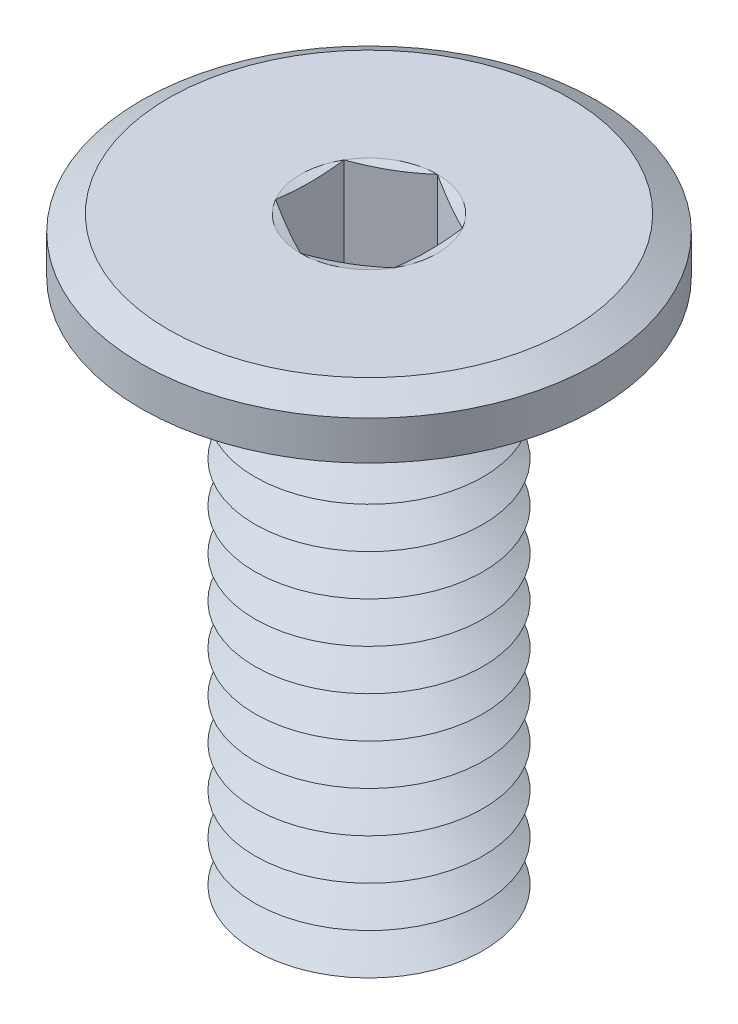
ISO-10303-21;
HEADER;
FILE_DESCRIPTION(('STEP AP214'),'2;1');
FILE_NAME('part.step','',(''),(''),'','','');
FILE_SCHEMA(('AUTOMOTIVE_DESIGN { 1 0 10303 214 1 1 1 1 }'));
ENDSEC;
DATA;
#1=APPLICATION_CONTEXT('core data for automotive mechanical design processes');
#2=APPLICATION_PROTOCOL_DEFINITION('international standard','automotive_design',2000,#1);
#3=PRODUCT_CONTEXT('',#1,'mechanical');
#4=PRODUCT('Part','Part','',(#3));
#5=PRODUCT_RELATED_PRODUCT_CATEGORY('part','',(#4));
#6=PRODUCT_DEFINITION_FORMATION('','',#4);
#7=PRODUCT_DEFINITION_CONTEXT('part definition',#1,'design');
#8=PRODUCT_DEFINITION('design','',#6,#7);
#9=PRODUCT_DEFINITION_SHAPE('','',#8);
#10=(LENGTH_UNIT() NAMED_UNIT(*) SI_UNIT(.MILLI.,.METRE.));
#11=(NAMED_UNIT(*) PLANE_ANGLE_UNIT() SI_UNIT($,.RADIAN.));
#12=(NAMED_UNIT(*) SI_UNIT($,.STERADIAN.) SOLID_ANGLE_UNIT());
#13=UNCERTAINTY_MEASURE_WITH_UNIT(LENGTH_MEASURE(1.E-05),#10,'distance_accuracy_value','');
#14=(GEOMETRIC_REPRESENTATION_CONTEXT(3) GLOBAL_UNCERTAINTY_ASSIGNED_CONTEXT((#13)) GLOBAL_UNIT_ASSIGNED_CONTEXT((#10,
#11,#12)) REPRESENTATION_CONTEXT('',''));
#15=CARTESIAN_POINT('',(0.,0.,0.));
#16=DIRECTION('',(0.,0.,1.));
#17=DIRECTION('',(1.,0.,0.));
#18=AXIS2_PLACEMENT_3D('',#15,#16,#17);
#19=CARTESIAN_POINT('',(0.,-5.925,0.));
#20=DIRECTION('',(0.,-1.,0.));
#21=DIRECTION('',(0.,0.,-1.));
#22=AXIS2_PLACEMENT_3D('',#19,#20,#21);
#23=CONICAL_SURFACE('',#22,1.25,1.0471975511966);
#24=CARTESIAN_POINT('',(0.,-5.7,0.));
#25=DIRECTION('',(0.,1.,0.));
#26=DIRECTION('',(0.,0.,1.));
#27=AXIS2_PLACEMENT_3D('',#24,#25,#26);
#28=CIRCLE('',#27,0.860288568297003);
#29=CARTESIAN_POINT('',(0.,-5.7,0.860288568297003));
#30=VERTEX_POINT('',#29);
#31=EDGE_CURVE('E450',#30,#30,#28,.T.);
#32=ORIENTED_EDGE('',*,*,#31,.F.);
#33=EDGE_LOOP('',(#32));
#34=FACE_BOUND('',#33,.T.);
#35=CARTESIAN_POINT('',(0.,-5.925,0.));
#36=DIRECTION('',(0.,1.,0.));
#37=DIRECTION('',(0.,0.,1.));
#38=AXIS2_PLACEMENT_3D('',#35,#36,#37);
#39=CIRCLE('',#38,1.25);
#40=CARTESIAN_POINT('',(0.,-5.925,1.25));
#41=VERTEX_POINT('',#40);
#42=EDGE_CURVE('E454',#41,#41,#39,.T.);
#43=ORIENTED_EDGE('',*,*,#42,.T.);
#44=EDGE_LOOP('',(#43));
#45=FACE_BOUND('',#44,.T.);
#46=ADVANCED_FACE('F39',(#34,#45),#23,.T.);
#47=CARTESIAN_POINT('',(0.,-5.7,0.));
#48=DIRECTION('',(0.,1.,0.));
#49=DIRECTION('',(0.,0.,1.));
#50=AXIS2_PLACEMENT_3D('',#47,#48,#49);
#51=CONICAL_SURFACE('',#50,0.860288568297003,1.0471975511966);
#52=CARTESIAN_POINT('',(0.,-5.475,0.));
#53=DIRECTION('',(0.,1.,0.));
#54=DIRECTION('',(0.,0.,1.));
#55=AXIS2_PLACEMENT_3D('',#52,#53,#54);
#56=CIRCLE('',#55,1.25);
#57=CARTESIAN_POINT('',(0.,-5.475,1.25));
#58=VERTEX_POINT('',#57);
#59=EDGE_CURVE('E446',#58,#58,#56,.T.);
#60=ORIENTED_EDGE('',*,*,#59,.F.);
#61=EDGE_LOOP('',(#60));
#62=FACE_BOUND('',#61,.T.);
#63=ORIENTED_EDGE('',*,*,#31,.T.);
#64=EDGE_LOOP('',(#63));
#65=FACE_BOUND('',#64,.T.);
#66=ADVANCED_FACE('F233',(#62,#65),#51,.T.);
#67=CARTESIAN_POINT('',(0.,-6.6,0.));
#68=DIRECTION('',(0.,-1.,0.));
#69=DIRECTION('',(0.,0.,-1.));
#70=AXIS2_PLACEMENT_3D('',#67,#68,#69);
#71=PLANE('',#70);
#72=CARTESIAN_POINT('',(0.,-6.6,0.));
#73=DIRECTION('',(0.,1.,0.));
#74=DIRECTION('',(0.,0.,1.));
#75=AXIS2_PLACEMENT_3D('',#72,#73,#74);
#76=CIRCLE('',#75,0.860288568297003);
#77=CARTESIAN_POINT('',(0.,-6.6,0.860288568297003));
#78=VERTEX_POINT('',#77);
#79=EDGE_CURVE('E300',#78,#78,#76,.T.);
#80=ORIENTED_EDGE('',*,*,#79,.F.);
#81=EDGE_LOOP('',(#80));
#82=FACE_BOUND('',#81,.T.);
#83=ADVANCED_FACE('F239',(#82),#71,.T.);
#84=CARTESIAN_POINT('',(0.,-6.6,0.));
#85=DIRECTION('',(0.,1.,0.));
#86=DIRECTION('',(0.,0.,1.));
#87=AXIS2_PLACEMENT_3D('',#84,#85,#86);
#88=CONICAL_SURFACE('',#87,0.860288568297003,1.0471975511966);
#89=CARTESIAN_POINT('',(0.,-6.375,0.));
#90=DIRECTION('',(0.,1.,0.));
#91=DIRECTION('',(0.,0.,1.));
#92=AXIS2_PLACEMENT_3D('',#89,#90,#91);
#93=CIRCLE('',#92,1.25);
#94=CARTESIAN_POINT('',(0.,-6.375,1.25));
#95=VERTEX_POINT('',#94);
#96=EDGE_CURVE('E462',#95,#95,#93,.T.);
#97=ORIENTED_EDGE('',*,*,#96,.F.);
#98=EDGE_LOOP('',(#97));
#99=FACE_BOUND('',#98,.T.);
#100=ORIENTED_EDGE('',*,*,#79,.T.);
#101=EDGE_LOOP('',(#100));
#102=FACE_BOUND('',#101,.T.);
#103=ADVANCED_FACE('F254',(#99,#102),#88,.T.);
#104=CARTESIAN_POINT('',(0.,-6.375,0.));
#105=DIRECTION('',(0.,-1.,0.));
#106=DIRECTION('',(0.,0.,-1.));
#107=AXIS2_PLACEMENT_3D('',#104,#105,#106);
#108=CONICAL_SURFACE('',#107,1.25,1.0471975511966);
#109=CARTESIAN_POINT('',(0.,-6.15,0.));
#110=DIRECTION('',(0.,1.,0.));
#111=DIRECTION('',(0.,0.,1.));
#112=AXIS2_PLACEMENT_3D('',#109,#110,#111);
#113=CIRCLE('',#112,0.860288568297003);
#114=CARTESIAN_POINT('',(0.,-6.15,0.860288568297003));
#115=VERTEX_POINT('',#114);
#116=EDGE_CURVE('E458',#115,#115,#113,.T.);
#117=ORIENTED_EDGE('',*,*,#116,.F.);
#118=EDGE_LOOP('',(#117));
#119=FACE_BOUND('',#118,.T.);
#120=ORIENTED_EDGE('',*,*,#96,.T.);
#121=EDGE_LOOP('',(#120));
#122=FACE_BOUND('',#121,.T.);
#123=ADVANCED_FACE('F250',(#119,#122),#108,.T.);
#124=CARTESIAN_POINT('',(0.,-6.15,0.));
#125=DIRECTION('',(0.,1.,0.));
#126=DIRECTION('',(0.,0.,1.));
#127=AXIS2_PLACEMENT_3D('',#124,#125,#126);
#128=CONICAL_SURFACE('',#127,0.860288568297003,1.0471975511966);
#129=ORIENTED_EDGE('',*,*,#42,.F.);
#130=EDGE_LOOP('',(#129));
#131=FACE_BOUND('',#130,.T.);
#132=ORIENTED_EDGE('',*,*,#116,.T.);
#133=EDGE_LOOP('',(#132));
#134=FACE_BOUND('',#133,.T.);
#135=ADVANCED_FACE('F246',(#131,#134),#128,.T.);
#136=CARTESIAN_POINT('',(0.,-5.475,0.));
#137=DIRECTION('',(0.,-1.,0.));
#138=DIRECTION('',(0.,0.,-1.));
#139=AXIS2_PLACEMENT_3D('',#136,#137,#138);
#140=CONICAL_SURFACE('',#139,1.25,1.0471975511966);
#141=CARTESIAN_POINT('',(0.,-5.25,0.));
#142=DIRECTION('',(0.,1.,0.));
#143=DIRECTION('',(0.,0.,1.));
#144=AXIS2_PLACEMENT_3D('',#141,#142,#143);
#145=CIRCLE('',#144,0.860288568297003);
#146=CARTESIAN_POINT('',(0.,-5.25,0.860288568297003));
#147=VERTEX_POINT('',#146);
#148=EDGE_CURVE('E443',#147,#147,#145,.T.);
#149=ORIENTED_EDGE('',*,*,#148,.F.);
#150=EDGE_LOOP('',(#149));
#151=FACE_BOUND('',#150,.T.);
#152=ORIENTED_EDGE('',*,*,#59,.T.);
#153=EDGE_LOOP('',(#152));
#154=FACE_BOUND('',#153,.T.);
#155=ADVANCED_FACE('F249',(#151,#154),#140,.T.);
#156=CARTESIAN_POINT('',(0.,-5.25,0.));
#157=DIRECTION('',(0.,1.,0.));
#158=DIRECTION('',(0.,0.,1.));
#159=AXIS2_PLACEMENT_3D('',#156,#157,#158);
#160=CONICAL_SURFACE('',#159,0.860288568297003,1.0471975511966);
#161=CARTESIAN_POINT('',(0.,-5.025,0.));
#162=DIRECTION('',(0.,1.,0.));
#163=DIRECTION('',(0.,0.,1.));
#164=AXIS2_PLACEMENT_3D('',#161,#162,#163);
#165=CIRCLE('',#164,1.25);
#166=CARTESIAN_POINT('',(0.,-5.025,1.25));
#167=VERTEX_POINT('',#166);
#168=EDGE_CURVE('E439',#167,#167,#165,.T.);
#169=ORIENTED_EDGE('',*,*,#168,.F.);
#170=EDGE_LOOP('',(#169));
#171=FACE_BOUND('',#170,.T.);
#172=ORIENTED_EDGE('',*,*,#148,.T.);
#173=EDGE_LOOP('',(#172));
#174=FACE_BOUND('',#173,.T.);
#175=ADVANCED_FACE('F599',(#171,#174),#160,.T.);
#176=CARTESIAN_POINT('',(0.,-5.025,0.));
#177=DIRECTION('',(0.,-1.,0.));
#178=DIRECTION('',(0.,0.,-1.));
#179=AXIS2_PLACEMENT_3D('',#176,#177,#178);
#180=CONICAL_SURFACE('',#179,1.25,1.0471975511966);
#181=CARTESIAN_POINT('',(0.,-4.8,0.));
#182=DIRECTION('',(0.,1.,0.));
#183=DIRECTION('',(0.,0.,1.));
#184=AXIS2_PLACEMENT_3D('',#181,#182,#183);
#185=CIRCLE('',#184,0.860288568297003);
#186=CARTESIAN_POINT('',(0.,-4.8,0.860288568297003));
#187=VERTEX_POINT('',#186);
#188=EDGE_CURVE('E436',#187,#187,#185,.T.);
#189=ORIENTED_EDGE('',*,*,#188,.F.);
#190=EDGE_LOOP('',(#189));
#191=FACE_BOUND('',#190,.T.);
#192=ORIENTED_EDGE('',*,*,#168,.T.);
#193=EDGE_LOOP('',(#192));
#194=FACE_BOUND('',#193,.T.);
#195=ADVANCED_FACE('F595',(#191,#194),#180,.T.);
#196=CARTESIAN_POINT('',(0.,-4.8,0.));
#197=DIRECTION('',(0.,1.,0.));
#198=DIRECTION('',(0.,0.,1.));
#199=AXIS2_PLACEMENT_3D('',#196,#197,#198);
#200=CONICAL_SURFACE('',#199,0.860288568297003,1.0471975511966);
#201=CARTESIAN_POINT('',(0.,-4.575,0.));
#202=DIRECTION('',(0.,1.,0.));
#203=DIRECTION('',(0.,0.,1.));
#204=AXIS2_PLACEMENT_3D('',#201,#202,#203);
#205=CIRCLE('',#204,1.25);
#206=CARTESIAN_POINT('',(0.,-4.575,1.25));
#207=VERTEX_POINT('',#206);
#208=EDGE_CURVE('E433',#207,#207,#205,.T.);
#209=ORIENTED_EDGE('',*,*,#208,.F.);
#210=EDGE_LOOP('',(#209));
#211=FACE_BOUND('',#210,.T.);
#212=ORIENTED_EDGE('',*,*,#188,.T.);
#213=EDGE_LOOP('',(#212));
#214=FACE_BOUND('',#213,.T.);
#215=ADVANCED_FACE('F591',(#211,#214),#200,.T.);
#216=CARTESIAN_POINT('',(0.,-4.575,0.));
#217=DIRECTION('',(0.,-1.,0.));
#218=DIRECTION('',(0.,0.,-1.));
#219=AXIS2_PLACEMENT_3D('',#216,#217,#218);
#220=CONICAL_SURFACE('',#219,1.25,1.0471975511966);
#221=CARTESIAN_POINT('',(0.,-4.35,0.));
#222=DIRECTION('',(0.,1.,0.));
#223=DIRECTION('',(0.,0.,1.));
#224=AXIS2_PLACEMENT_3D('',#221,#222,#223);
#225=CIRCLE('',#224,0.860288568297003);
#226=CARTESIAN_POINT('',(0.,-4.35,0.860288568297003));
#227=VERTEX_POINT('',#226);
#228=EDGE_CURVE('E429',#227,#227,#225,.T.);
#229=ORIENTED_EDGE('',*,*,#228,.F.);
#230=EDGE_LOOP('',(#229));
#231=FACE_BOUND('',#230,.T.);
#232=ORIENTED_EDGE('',*,*,#208,.T.);
#233=EDGE_LOOP('',(#232));
#234=FACE_BOUND('',#233,.T.);
#235=ADVANCED_FACE('F587',(#231,#234),#220,.T.);
#236=CARTESIAN_POINT('',(0.,-4.35,0.));
#237=DIRECTION('',(0.,1.,0.));
#238=DIRECTION('',(0.,0.,1.));
#239=AXIS2_PLACEMENT_3D('',#236,#237,#238);
#240=CONICAL_SURFACE('',#239,0.860288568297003,1.0471975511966);
#241=CARTESIAN_POINT('',(0.,-4.125,0.));
#242=DIRECTION('',(0.,1.,0.));
#243=DIRECTION('',(0.,0.,1.));
#244=AXIS2_PLACEMENT_3D('',#241,#242,#243);
#245=CIRCLE('',#244,1.25);
#246=CARTESIAN_POINT('',(0.,-4.125,1.25));
#247=VERTEX_POINT('',#246);
#248=EDGE_CURVE('E425',#247,#247,#245,.T.);
#249=ORIENTED_EDGE('',*,*,#248,.F.);
#250=EDGE_LOOP('',(#249));
#251=FACE_BOUND('',#250,.T.);
#252=ORIENTED_EDGE('',*,*,#228,.T.);
#253=EDGE_LOOP('',(#252));
#254=FACE_BOUND('',#253,.T.);
#255=ADVANCED_FACE('F583',(#251,#254),#240,.T.);
#256=CARTESIAN_POINT('',(0.,-4.125,0.));
#257=DIRECTION('',(0.,-1.,0.));
#258=DIRECTION('',(0.,0.,-1.));
#259=AXIS2_PLACEMENT_3D('',#256,#257,#258);
#260=CONICAL_SURFACE('',#259,1.25,1.0471975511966);
#261=CARTESIAN_POINT('',(0.,-3.9,0.));
#262=DIRECTION('',(0.,1.,0.));
#263=DIRECTION('',(0.,0.,1.));
#264=AXIS2_PLACEMENT_3D('',#261,#262,#263);
#265=CIRCLE('',#264,0.860288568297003);
#266=CARTESIAN_POINT('',(0.,-3.9,0.860288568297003));
#267=VERTEX_POINT('',#266);
#268=EDGE_CURVE('E421',#267,#267,#265,.T.);
#269=ORIENTED_EDGE('',*,*,#268,.F.);
#270=EDGE_LOOP('',(#269));
#271=FACE_BOUND('',#270,.T.);
#272=ORIENTED_EDGE('',*,*,#248,.T.);
#273=EDGE_LOOP('',(#272));
#274=FACE_BOUND('',#273,.T.);
#275=ADVANCED_FACE('F579',(#271,#274),#260,.T.);
#276=CARTESIAN_POINT('',(0.,-3.9,0.));
#277=DIRECTION('',(0.,1.,0.));
#278=DIRECTION('',(0.,0.,1.));
#279=AXIS2_PLACEMENT_3D('',#276,#277,#278);
#280=CONICAL_SURFACE('',#279,0.860288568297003,1.0471975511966);
#281=CARTESIAN_POINT('',(0.,-3.675,0.));
#282=DIRECTION('',(0.,1.,0.));
#283=DIRECTION('',(0.,0.,1.));
#284=AXIS2_PLACEMENT_3D('',#281,#282,#283);
#285=CIRCLE('',#284,1.25);
#286=CARTESIAN_POINT('',(0.,-3.675,1.25));
#287=VERTEX_POINT('',#286);
#288=EDGE_CURVE('E417',#287,#287,#285,.T.);
#289=ORIENTED_EDGE('',*,*,#288,.F.);
#290=EDGE_LOOP('',(#289));
#291=FACE_BOUND('',#290,.T.);
#292=ORIENTED_EDGE('',*,*,#268,.T.);
#293=EDGE_LOOP('',(#292));
#294=FACE_BOUND('',#293,.T.);
#295=ADVANCED_FACE('F575',(#291,#294),#280,.T.);
#296=CARTESIAN_POINT('',(0.,-3.675,0.));
#297=DIRECTION('',(0.,-1.,0.));
#298=DIRECTION('',(0.,0.,-1.));
#299=AXIS2_PLACEMENT_3D('',#296,#297,#298);
#300=CONICAL_SURFACE('',#299,1.25,1.0471975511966);
#301=CARTESIAN_POINT('',(0.,-3.45,0.));
#302=DIRECTION('',(0.,1.,0.));
#303=DIRECTION('',(0.,0.,1.));
#304=AXIS2_PLACEMENT_3D('',#301,#302,#303);
#305=CIRCLE('',#304,0.860288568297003);
#306=CARTESIAN_POINT('',(0.,-3.45,0.860288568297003));
#307=VERTEX_POINT('',#306);
#308=EDGE_CURVE('E413',#307,#307,#305,.T.);
#309=ORIENTED_EDGE('',*,*,#308,.F.);
#310=EDGE_LOOP('',(#309));
#311=FACE_BOUND('',#310,.T.);
#312=ORIENTED_EDGE('',*,*,#288,.T.);
#313=EDGE_LOOP('',(#312));
#314=FACE_BOUND('',#313,.T.);
#315=ADVANCED_FACE('F571',(#311,#314),#300,.T.);
#316=CARTESIAN_POINT('',(0.,-3.45,0.));
#317=DIRECTION('',(0.,1.,0.));
#318=DIRECTION('',(0.,0.,1.));
#319=AXIS2_PLACEMENT_3D('',#316,#317,#318);
#320=CONICAL_SURFACE('',#319,0.860288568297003,1.0471975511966);
#321=CARTESIAN_POINT('',(0.,-3.225,0.));
#322=DIRECTION('',(0.,1.,0.));
#323=DIRECTION('',(0.,0.,1.));
#324=AXIS2_PLACEMENT_3D('',#321,#322,#323);
#325=CIRCLE('',#324,1.25);
#326=CARTESIAN_POINT('',(0.,-3.225,1.25));
#327=VERTEX_POINT('',#326);
#328=EDGE_CURVE('E409',#327,#327,#325,.T.);
#329=ORIENTED_EDGE('',*,*,#328,.F.);
#330=EDGE_LOOP('',(#329));
#331=FACE_BOUND('',#330,.T.);
#332=ORIENTED_EDGE('',*,*,#308,.T.);
#333=EDGE_LOOP('',(#332));
#334=FACE_BOUND('',#333,.T.);
#335=ADVANCED_FACE('F567',(#331,#334),#320,.T.);
#336=CARTESIAN_POINT('',(0.,-3.225,0.));
#337=DIRECTION('',(0.,-1.,0.));
#338=DIRECTION('',(0.,0.,-1.));
#339=AXIS2_PLACEMENT_3D('',#336,#337,#338);
#340=CONICAL_SURFACE('',#339,1.25,1.0471975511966);
#341=CARTESIAN_POINT('',(0.,-3.,0.));
#342=DIRECTION('',(0.,1.,0.));
#343=DIRECTION('',(0.,0.,1.));
#344=AXIS2_PLACEMENT_3D('',#341,#342,#343);
#345=CIRCLE('',#344,0.860288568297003);
#346=CARTESIAN_POINT('',(0.,-3.,0.860288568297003));
#347=VERTEX_POINT('',#346);
#348=EDGE_CURVE('E405',#347,#347,#345,.T.);
#349=ORIENTED_EDGE('',*,*,#348,.F.);
#350=EDGE_LOOP('',(#349));
#351=FACE_BOUND('',#350,.T.);
#352=ORIENTED_EDGE('',*,*,#328,.T.);
#353=EDGE_LOOP('',(#352));
#354=FACE_BOUND('',#353,.T.);
#355=ADVANCED_FACE('F563',(#351,#354),#340,.T.);
#356=CARTESIAN_POINT('',(0.,-3.,0.));
#357=DIRECTION('',(0.,1.,0.));
#358=DIRECTION('',(0.,0.,1.));
#359=AXIS2_PLACEMENT_3D('',#356,#357,#358);
#360=CONICAL_SURFACE('',#359,0.860288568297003,1.0471975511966);
#361=CARTESIAN_POINT('',(0.,-2.775,0.));
#362=DIRECTION('',(0.,1.,0.));
#363=DIRECTION('',(0.,0.,1.));
#364=AXIS2_PLACEMENT_3D('',#361,#362,#363);
#365=CIRCLE('',#364,1.25);
#366=CARTESIAN_POINT('',(0.,-2.775,1.25));
#367=VERTEX_POINT('',#366);
#368=EDGE_CURVE('E401',#367,#367,#365,.T.);
#369=ORIENTED_EDGE('',*,*,#368,.F.);
#370=EDGE_LOOP('',(#369));
#371=FACE_BOUND('',#370,.T.);
#372=ORIENTED_EDGE('',*,*,#348,.T.);
#373=EDGE_LOOP('',(#372));
#374=FACE_BOUND('',#373,.T.);
#375=ADVANCED_FACE('F559',(#371,#374),#360,.T.);
#376=CARTESIAN_POINT('',(0.,-2.775,0.));
#377=DIRECTION('',(0.,-1.,0.));
#378=DIRECTION('',(0.,0.,-1.));
#379=AXIS2_PLACEMENT_3D('',#376,#377,#378);
#380=CONICAL_SURFACE('',#379,1.25,1.0471975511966);
#381=CARTESIAN_POINT('',(0.,-2.55,0.));
#382=DIRECTION('',(0.,1.,0.));
#383=DIRECTION('',(0.,0.,1.));
#384=AXIS2_PLACEMENT_3D('',#381,#382,#383);
#385=CIRCLE('',#384,0.860288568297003);
#386=CARTESIAN_POINT('',(0.,-2.55,0.860288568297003));
#387=VERTEX_POINT('',#386);
#388=EDGE_CURVE('E398',#387,#387,#385,.T.);
#389=ORIENTED_EDGE('',*,*,#388,.F.);
#390=EDGE_LOOP('',(#389));
#391=FACE_BOUND('',#390,.T.);
#392=ORIENTED_EDGE('',*,*,#368,.T.);
#393=EDGE_LOOP('',(#392));
#394=FACE_BOUND('',#393,.T.);
#395=ADVANCED_FACE('F555',(#391,#394),#380,.T.);
#396=CARTESIAN_POINT('',(0.,-2.55,0.));
#397=DIRECTION('',(0.,1.,0.));
#398=DIRECTION('',(0.,0.,1.));
#399=AXIS2_PLACEMENT_3D('',#396,#397,#398);
#400=CONICAL_SURFACE('',#399,0.860288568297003,1.0471975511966);
#401=CARTESIAN_POINT('',(0.,-2.325,0.));
#402=DIRECTION('',(0.,1.,0.));
#403=DIRECTION('',(0.,0.,1.));
#404=AXIS2_PLACEMENT_3D('',#401,#402,#403);
#405=CIRCLE('',#404,1.25);
#406=CARTESIAN_POINT('',(0.,-2.325,1.25));
#407=VERTEX_POINT('',#406);
#408=EDGE_CURVE('E395',#407,#407,#405,.T.);
#409=ORIENTED_EDGE('',*,*,#408,.F.);
#410=EDGE_LOOP('',(#409));
#411=FACE_BOUND('',#410,.T.);
#412=ORIENTED_EDGE('',*,*,#388,.T.);
#413=EDGE_LOOP('',(#412));
#414=FACE_BOUND('',#413,.T.);
#415=ADVANCED_FACE('F551',(#411,#414),#400,.T.);
#416=CARTESIAN_POINT('',(0.,-2.325,0.));
#417=DIRECTION('',(0.,-1.,0.));
#418=DIRECTION('',(0.,0.,-1.));
#419=AXIS2_PLACEMENT_3D('',#416,#417,#418);
#420=CONICAL_SURFACE('',#419,1.25,1.0471975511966);
#421=CARTESIAN_POINT('',(0.,-2.1,0.));
#422=DIRECTION('',(0.,1.,0.));
#423=DIRECTION('',(0.,0.,1.));
#424=AXIS2_PLACEMENT_3D('',#421,#422,#423);
#425=CIRCLE('',#424,0.860288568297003);
#426=CARTESIAN_POINT('',(0.,-2.1,0.860288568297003));
#427=VERTEX_POINT('',#426);
#428=EDGE_CURVE('E392',#427,#427,#425,.T.);
#429=ORIENTED_EDGE('',*,*,#428,.F.);
#430=EDGE_LOOP('',(#429));
#431=FACE_BOUND('',#430,.T.);
#432=ORIENTED_EDGE('',*,*,#408,.T.);
#433=EDGE_LOOP('',(#432));
#434=FACE_BOUND('',#433,.T.);
#435=ADVANCED_FACE('F547',(#431,#434),#420,.T.);
#436=CARTESIAN_POINT('',(0.,-2.1,0.));
#437=DIRECTION('',(0.,1.,0.));
#438=DIRECTION('',(0.,0.,1.));
#439=AXIS2_PLACEMENT_3D('',#436,#437,#438);
#440=CONICAL_SURFACE('',#439,0.860288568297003,1.0471975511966);
#441=CARTESIAN_POINT('',(0.,-1.875,0.));
#442=DIRECTION('',(0.,1.,0.));
#443=DIRECTION('',(0.,0.,1.));
#444=AXIS2_PLACEMENT_3D('',#441,#442,#443);
#445=CIRCLE('',#444,1.25);
#446=CARTESIAN_POINT('',(0.,-1.875,1.25));
#447=VERTEX_POINT('',#446);
#448=EDGE_CURVE('E388',#447,#447,#445,.T.);
#449=ORIENTED_EDGE('',*,*,#448,.F.);
#450=EDGE_LOOP('',(#449));
#451=FACE_BOUND('',#450,.T.);
#452=ORIENTED_EDGE('',*,*,#428,.T.);
#453=EDGE_LOOP('',(#452));
#454=FACE_BOUND('',#453,.T.);
#455=ADVANCED_FACE('F543',(#451,#454),#440,.T.);
#456=CARTESIAN_POINT('',(0.,-1.875,0.));
#457=DIRECTION('',(0.,-1.,0.));
#458=DIRECTION('',(0.,0.,-1.));
#459=AXIS2_PLACEMENT_3D('',#456,#457,#458);
#460=CONICAL_SURFACE('',#459,1.25,1.0471975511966);
#461=CARTESIAN_POINT('',(0.,-1.65,0.));
#462=DIRECTION('',(0.,1.,0.));
#463=DIRECTION('',(0.,0.,1.));
#464=AXIS2_PLACEMENT_3D('',#461,#462,#463);
#465=CIRCLE('',#464,0.860288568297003);
#466=CARTESIAN_POINT('',(0.,-1.65,0.860288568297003));
#467=VERTEX_POINT('',#466);
#468=EDGE_CURVE('E384',#467,#467,#465,.T.);
#469=ORIENTED_EDGE('',*,*,#468,.F.);
#470=EDGE_LOOP('',(#469));
#471=FACE_BOUND('',#470,.T.);
#472=ORIENTED_EDGE('',*,*,#448,.T.);
#473=EDGE_LOOP('',(#472));
#474=FACE_BOUND('',#473,.T.);
#475=ADVANCED_FACE('F539',(#471,#474),#460,.T.);
#476=CARTESIAN_POINT('',(0.,-1.65,0.));
#477=DIRECTION('',(0.,1.,0.));
#478=DIRECTION('',(0.,0.,1.));
#479=AXIS2_PLACEMENT_3D('',#476,#477,#478);
#480=CONICAL_SURFACE('',#479,0.860288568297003,1.0471975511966);
#481=CARTESIAN_POINT('',(0.,-1.425,0.));
#482=DIRECTION('',(0.,1.,0.));
#483=DIRECTION('',(0.,0.,1.));
#484=AXIS2_PLACEMENT_3D('',#481,#482,#483);
#485=CIRCLE('',#484,1.25);
#486=CARTESIAN_POINT('',(0.,-1.425,1.25));
#487=VERTEX_POINT('',#486);
#488=EDGE_CURVE('E368',#487,#487,#485,.T.);
#489=ORIENTED_EDGE('',*,*,#488,.F.);
#490=EDGE_LOOP('',(#489));
#491=FACE_BOUND('',#490,.T.);
#492=ORIENTED_EDGE('',*,*,#468,.T.);
#493=EDGE_LOOP('',(#492));
#494=FACE_BOUND('',#493,.T.);
#495=ADVANCED_FACE('F274',(#491,#494),#480,.T.);
#496=CARTESIAN_POINT('',(0.,0.,0.));
#497=DIRECTION('',(0.,1.,0.));
#498=DIRECTION('',(0.,0.,1.));
#499=AXIS2_PLACEMENT_3D('',#496,#497,#498);
#500=PLANE('',#499);
#501=CARTESIAN_POINT('',(0.,0.,0.));
#502=DIRECTION('',(0.,1.,0.));
#503=DIRECTION('',(0.,0.,1.));
#504=AXIS2_PLACEMENT_3D('',#501,#502,#503);
#505=CIRCLE('',#504,0.750555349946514);
#506=CARTESIAN_POINT('',(0.,0.,0.750555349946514));
#507=VERTEX_POINT('',#506);
#508=CARTESIAN_POINT('',(0.65,0.,0.375277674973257));
#509=VERTEX_POINT('',#508);
#510=EDGE_CURVE('E66',#507,#509,#505,.T.);
#511=ORIENTED_EDGE('',*,*,#510,.F.);
#512=CARTESIAN_POINT('',(-0.65,0.,0.375277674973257));
#513=VERTEX_POINT('',#512);
#514=EDGE_CURVE('E169',#513,#507,#505,.T.);
#515=ORIENTED_EDGE('',*,*,#514,.F.);
#516=CARTESIAN_POINT('',(-0.65,0.,-0.375277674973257));
#517=VERTEX_POINT('',#516);
#518=EDGE_CURVE('E164',#517,#513,#505,.T.);
#519=ORIENTED_EDGE('',*,*,#518,.F.);
#520=CARTESIAN_POINT('',(0.,0.,-0.750555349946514));
#521=VERTEX_POINT('',#520);
#522=EDGE_CURVE('E128',#521,#517,#505,.T.);
#523=ORIENTED_EDGE('',*,*,#522,.F.);
#524=CARTESIAN_POINT('',(0.65,0.,-0.375277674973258));
#525=VERTEX_POINT('',#524);
#526=EDGE_CURVE('E119',#525,#521,#505,.T.);
#527=ORIENTED_EDGE('',*,*,#526,.F.);
#528=EDGE_CURVE('E59',#509,#525,#505,.T.);
#529=ORIENTED_EDGE('',*,*,#528,.F.);
#530=EDGE_LOOP('',(#511,#515,#519,#523,#527,#529));
#531=FACE_BOUND('',#530,.T.);
#532=CARTESIAN_POINT('',(0.,0.,0.));
#533=DIRECTION('',(0.,1.,0.));
#534=DIRECTION('',(0.,0.,1.));
#535=AXIS2_PLACEMENT_3D('',#532,#533,#534);
#536=CIRCLE('',#535,2.2);
#537=CARTESIAN_POINT('',(0.,0.,2.2));
#538=VERTEX_POINT('',#537);
#539=EDGE_CURVE('E296',#538,#538,#536,.T.);
#540=ORIENTED_EDGE('',*,*,#539,.T.);
#541=EDGE_LOOP('',(#540));
#542=FACE_BOUND('',#541,.T.);
#543=ADVANCED_FACE('F160',(#531,#542),#500,.T.);
#544=CARTESIAN_POINT('',(0.,-0.6,0.));
#545=DIRECTION('',(0.,1.,0.));
#546=DIRECTION('',(0.,0.,1.));
#547=AXIS2_PLACEMENT_3D('',#544,#545,#546);
#548=CYLINDRICAL_SURFACE('',#547,2.5);
#549=CARTESIAN_POINT('',(0.,-0.173205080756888,0.));
#550=DIRECTION('',(0.,1.,0.));
#551=DIRECTION('',(0.,0.,1.));
#552=AXIS2_PLACEMENT_3D('',#549,#550,#551);
#553=CIRCLE('',#552,2.5);
#554=CARTESIAN_POINT('',(0.,-0.173205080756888,2.5));
#555=VERTEX_POINT('',#554);
#556=EDGE_CURVE('E307',#555,#555,#553,.F.);
#557=ORIENTED_EDGE('',*,*,#556,.T.);
#558=EDGE_LOOP('',(#557));
#559=FACE_BOUND('',#558,.T.);
#560=CARTESIAN_POINT('',(0.,-0.6,0.));
#561=DIRECTION('',(0.,1.,0.));
#562=DIRECTION('',(0.,0.,1.));
#563=AXIS2_PLACEMENT_3D('',#560,#561,#562);
#564=CIRCLE('',#563,2.5);
#565=CARTESIAN_POINT('',(0.,-0.6,2.5));
#566=VERTEX_POINT('',#565);
#567=EDGE_CURVE('E291',#566,#566,#564,.T.);
#568=ORIENTED_EDGE('',*,*,#567,.T.);
#569=EDGE_LOOP('',(#568));
#570=FACE_BOUND('',#569,.T.);
#571=ADVANCED_FACE('F270',(#559,#570),#548,.T.);
#572=CARTESIAN_POINT('',(0.,-0.6,0.));
#573=DIRECTION('',(0.,1.,0.));
#574=DIRECTION('',(0.,0.,1.));
#575=AXIS2_PLACEMENT_3D('',#572,#573,#574);
#576=PLANE('',#575);
#577=CARTESIAN_POINT('',(0.,-0.6,0.));
#578=DIRECTION('',(0.,1.,0.));
#579=DIRECTION('',(0.,0.,1.));
#580=AXIS2_PLACEMENT_3D('',#577,#578,#579);
#581=CIRCLE('',#580,1.35);
#582=CARTESIAN_POINT('',(0.,-0.6,1.35));
#583=VERTEX_POINT('',#582);
#584=EDGE_CURVE('E286',#583,#583,#581,.T.);
#585=ORIENTED_EDGE('',*,*,#584,.T.);
#586=EDGE_LOOP('',(#585));
#587=FACE_BOUND('',#586,.T.);
#588=ORIENTED_EDGE('',*,*,#567,.F.);
#589=EDGE_LOOP('',(#588));
#590=FACE_BOUND('',#589,.T.);
#591=ADVANCED_FACE('F266',(#587,#590),#576,.F.);
#592=CARTESIAN_POINT('',(0.,-6.6,0.));
#593=DIRECTION('',(0.,1.,0.));
#594=DIRECTION('',(0.,0.,1.));
#595=AXIS2_PLACEMENT_3D('',#592,#593,#594);
#596=CYLINDRICAL_SURFACE('',#595,1.25);
#597=CARTESIAN_POINT('',(0.,-0.7,0.));
#598=DIRECTION('',(0.,1.,0.));
#599=DIRECTION('',(0.,0.,1.));
#600=AXIS2_PLACEMENT_3D('',#597,#598,#599);
#601=CIRCLE('',#600,1.25);
#602=CARTESIAN_POINT('',(0.,-0.7,1.25));
#603=VERTEX_POINT('',#602);
#604=EDGE_CURVE('E289',#603,#603,#601,.F.);
#605=ORIENTED_EDGE('',*,*,#604,.T.);
#606=EDGE_LOOP('',(#605));
#607=FACE_BOUND('',#606,.T.);
#608=ORIENTED_EDGE('',*,*,#488,.T.);
#609=EDGE_LOOP('',(#608));
#610=FACE_BOUND('',#609,.T.);
#611=ADVANCED_FACE('F262',(#607,#610),#596,.T.);
#612=CARTESIAN_POINT('',(0.,-0.7,0.));
#613=DIRECTION('',(0.,1.,0.));
#614=DIRECTION('',(0.,0.,1.));
#615=AXIS2_PLACEMENT_3D('',#612,#613,#614);
#616=TOROIDAL_SURFACE('',#615,1.35,0.1);
#617=ORIENTED_EDGE('',*,*,#584,.F.);
#618=EDGE_LOOP('',(#617));
#619=FACE_BOUND('',#618,.T.);
#620=ORIENTED_EDGE('',*,*,#604,.F.);
#621=EDGE_LOOP('',(#620));
#622=FACE_BOUND('',#621,.T.);
#623=ADVANCED_FACE('F265',(#619,#622),#616,.F.);
#624=CARTESIAN_POINT('',(0.,0.,0.));
#625=DIRECTION('',(0.,-1.,0.));
#626=DIRECTION('',(0.,0.,-1.));
#627=AXIS2_PLACEMENT_3D('',#624,#625,#626);
#628=CONICAL_SURFACE('',#627,2.2,1.0471975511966);
#629=ORIENTED_EDGE('',*,*,#556,.F.);
#630=EDGE_LOOP('',(#629));
#631=FACE_BOUND('',#630,.T.);
#632=ORIENTED_EDGE('',*,*,#539,.F.);
#633=EDGE_LOOP('',(#632));
#634=FACE_BOUND('',#633,.T.);
#635=ADVANCED_FACE('F41',(#631,#634),#628,.T.);
#636=CARTESIAN_POINT('',(0.,0.,0.));
#637=DIRECTION('',(0.,1.,0.));
#638=DIRECTION('',(0.,0.,1.));
#639=AXIS2_PLACEMENT_3D('',#636,#637,#638);
#640=CONICAL_SURFACE('',#639,0.750555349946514,1.30899693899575);
#641=ORIENTED_EDGE('',*,*,#522,.T.);
#642=CARTESIAN_POINT('',(0.000200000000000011,3.09472466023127E-05,-0.750670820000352));
#643=CARTESIAN_POINT('',(-0.0268094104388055,-0.00415092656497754,-0.735076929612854));
#644=CARTESIAN_POINT('',(-0.0538678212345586,-0.00794750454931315,-0.719454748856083));
#645=CARTESIAN_POINT('',(-0.108080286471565,-0.0146178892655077,-0.688155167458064));
#646=CARTESIAN_POINT('',(-0.135234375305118,-0.0174913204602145,-0.672477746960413));
#647=CARTESIAN_POINT('',(-0.18947340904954,-0.0221475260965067,-0.641162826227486));
#648=CARTESIAN_POINT('',(-0.216557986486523,-0.0239358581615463,-0.625525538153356));
#649=CARTESIAN_POINT('',(-0.270761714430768,-0.0263338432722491,-0.594231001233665));
#650=CARTESIAN_POINT('',(-0.297880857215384,-0.0269437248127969,-0.578573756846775));
#651=CARTESIAN_POINT('',(-0.352119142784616,-0.0269437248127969,-0.547259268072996));
#652=CARTESIAN_POINT('',(-0.379238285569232,-0.0263338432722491,-0.531602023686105));
#653=CARTESIAN_POINT('',(-0.433442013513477,-0.0239358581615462,-0.500307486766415));
#654=CARTESIAN_POINT('',(-0.460526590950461,-0.0221475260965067,-0.484670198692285));
#655=CARTESIAN_POINT('',(-0.514765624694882,-0.0174913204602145,-0.453355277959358));
#656=CARTESIAN_POINT('',(-0.541919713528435,-0.0146178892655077,-0.437677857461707));
#657=CARTESIAN_POINT('',(-0.596132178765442,-0.00794750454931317,-0.406378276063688));
#658=CARTESIAN_POINT('',(-0.623190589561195,-0.00415092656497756,-0.390756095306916));
#659=CARTESIAN_POINT('',(-0.6502,3.09472466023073E-05,-0.375162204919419));
#660=B_SPLINE_CURVE_WITH_KNOTS('',3,(#642,#643,#644,#645,#646,#647,#648,#649,#650,#651,#652,
#653,#654,#655,#656,#657,#658,#659),.UNSPECIFIED.,.F.,.F.,(4,2,2,2,2,2,2,2,4),(0.,
0.0944056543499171,0.188849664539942,0.282805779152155,0.376743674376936,0.470681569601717,
0.564637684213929,0.659081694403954,0.753487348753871),.UNSPECIFIED.);
#661=EDGE_CURVE('E11',#521,#517,#660,.T.);
#662=ORIENTED_EDGE('',*,*,#661,.F.);
#663=EDGE_LOOP('',(#641,#662));
#664=FACE_BOUND('',#663,.T.);
#665=ADVANCED_FACE('F132',(#664),#640,.F.);
#666=ORIENTED_EDGE('',*,*,#518,.T.);
#667=CARTESIAN_POINT('',(-0.65,0.153431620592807,-1.15250975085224));
#668=CARTESIAN_POINT('',(-0.65,0.140485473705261,-1.09696292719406));
#669=CARTESIAN_POINT('',(-0.65,0.12772104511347,-1.04137089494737));
#670=CARTESIAN_POINT('',(-0.65,0.102806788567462,-0.93003898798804));
#671=CARTESIAN_POINT('',(-0.65,0.0906570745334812,-0.874299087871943));
#672=CARTESIAN_POINT('',(-0.65,0.0671143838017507,-0.762091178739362));
#673=CARTESIAN_POINT('',(-0.65,0.0557299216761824,-0.70562136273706));
#674=CARTESIAN_POINT('',(-0.65,0.0342960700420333,-0.59241870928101));
#675=CARTESIAN_POINT('',(-0.65,0.0242468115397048,-0.535685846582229));
#676=CARTESIAN_POINT('',(-0.65,0.00641278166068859,-0.423455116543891));
#677=CARTESIAN_POINT('',(-0.65,-0.00142665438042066,-0.367966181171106));
#678=CARTESIAN_POINT('',(-0.65,-0.0143371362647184,-0.256669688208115));
#679=CARTESIAN_POINT('',(-0.65,-0.0194090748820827,-0.200862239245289));
#680=CARTESIAN_POINT('',(-0.65,-0.025908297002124,-0.0892782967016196));
#681=CARTESIAN_POINT('',(-0.65,-0.0273521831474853,-0.0335028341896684));
#682=CARTESIAN_POINT('',(-0.65,-0.0263311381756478,0.078014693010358));
#683=CARTESIAN_POINT('',(-0.65,-0.0238659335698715,0.133756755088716));
#684=CARTESIAN_POINT('',(-0.65,-0.016691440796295,0.229596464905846));
#685=CARTESIAN_POINT('',(-0.65,-0.0127907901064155,0.269759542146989));
#686=CARTESIAN_POINT('',(-0.65,-0.00354681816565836,0.349915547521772));
#687=CARTESIAN_POINT('',(-0.65,0.00179646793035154,0.389908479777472));
#688=CARTESIAN_POINT('',(-0.65,0.0195190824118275,0.50990254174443));
#689=CARTESIAN_POINT('',(-0.65,0.0335668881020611,0.589653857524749));
#690=CARTESIAN_POINT('',(-0.65,0.0566589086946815,0.709742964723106));
#691=CARTESIAN_POINT('',(-0.65,0.0647873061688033,0.750268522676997));
#692=CARTESIAN_POINT('',(-0.65,0.0815416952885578,0.831218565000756));
#693=CARTESIAN_POINT('',(-0.65,0.0901676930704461,0.871643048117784));
#694=CARTESIAN_POINT('',(-0.65,0.107740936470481,0.952178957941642));
#695=CARTESIAN_POINT('',(-0.65,0.116686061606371,0.992290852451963));
#696=CARTESIAN_POINT('',(-0.65,0.134863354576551,1.07244661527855));
#697=CARTESIAN_POINT('',(-0.65,0.144095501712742,1.11249048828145));
#698=CARTESIAN_POINT('',(-0.65,0.153431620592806,1.15250975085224));
#699=B_SPLINE_CURVE_WITH_KNOTS('',3,(#667,#668,#669,#670,#671,#672,#673,#674,#675,#676,#677,
#678,#679,#680,#681,#682,#683,#684,#685,#686,#687,#688,#689,#690,#691,#692,#693,#694,#695,#696,
#697,#698),.UNSPECIFIED.,.F.,.F.,(4,2,2,2,2,2,2,2,2,2,2,2,2,2,2,4),(0.,0.171110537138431,
0.342252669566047,0.515060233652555,0.687884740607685,0.855957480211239,1.02397596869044,
1.19122416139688,1.3584840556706,1.4795115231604,1.60053604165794,1.84338230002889,
1.9673809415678,2.09138111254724,2.21467179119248,2.33795359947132),.UNSPECIFIED.);
#700=EDGE_CURVE('E172',#517,#513,#699,.T.);
#701=ORIENTED_EDGE('',*,*,#700,.F.);
#702=EDGE_LOOP('',(#666,#701));
#703=FACE_BOUND('',#702,.T.);
#704=ADVANCED_FACE('F490',(#703),#640,.F.);
#705=ORIENTED_EDGE('',*,*,#514,.T.);
#706=CARTESIAN_POINT('',(-0.6502,3.09472466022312E-05,0.375162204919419));
#707=CARTESIAN_POINT('',(-0.623190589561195,-0.0041509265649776,0.390756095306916));
#708=CARTESIAN_POINT('',(-0.596132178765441,-0.00794750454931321,0.406378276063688));
#709=CARTESIAN_POINT('',(-0.541919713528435,-0.0146178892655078,0.437677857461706));
#710=CARTESIAN_POINT('',(-0.514765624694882,-0.0174913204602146,0.453355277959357));
#711=CARTESIAN_POINT('',(-0.460526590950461,-0.0221475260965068,0.484670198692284));
#712=CARTESIAN_POINT('',(-0.433442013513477,-0.0239358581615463,0.500307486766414));
#713=CARTESIAN_POINT('',(-0.379238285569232,-0.0263338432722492,0.531602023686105));
#714=CARTESIAN_POINT('',(-0.352119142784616,-0.026943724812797,0.547259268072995));
#715=CARTESIAN_POINT('',(-0.297880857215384,-0.026943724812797,0.578573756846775));
#716=CARTESIAN_POINT('',(-0.270761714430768,-0.0263338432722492,0.594231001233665));
#717=CARTESIAN_POINT('',(-0.216557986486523,-0.0239358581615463,0.625525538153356));
#718=CARTESIAN_POINT('',(-0.18947340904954,-0.0221475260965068,0.641162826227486));
#719=CARTESIAN_POINT('',(-0.135234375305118,-0.0174913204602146,0.672477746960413));
#720=CARTESIAN_POINT('',(-0.108080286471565,-0.0146178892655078,0.688155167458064));
#721=CARTESIAN_POINT('',(-0.0538678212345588,-0.00794750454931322,0.719454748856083));
#722=CARTESIAN_POINT('',(-0.0268094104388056,-0.0041509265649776,0.735076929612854));
#723=CARTESIAN_POINT('',(0.000199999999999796,3.09472466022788E-05,0.750670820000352));
#724=B_SPLINE_CURVE_WITH_KNOTS('',3,(#706,#707,#708,#709,#710,#711,#712,#713,#714,#715,#716,
#717,#718,#719,#720,#721,#722,#723),.UNSPECIFIED.,.F.,.F.,(4,2,2,2,2,2,2,2,4),(0.,
0.0944056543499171,0.188849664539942,0.282805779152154,0.376743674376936,0.470681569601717,
0.564637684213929,0.659081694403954,0.753487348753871),.UNSPECIFIED.);
#725=EDGE_CURVE('E180',#513,#507,#724,.T.);
#726=ORIENTED_EDGE('',*,*,#725,.F.);
#727=EDGE_LOOP('',(#705,#726));
#728=FACE_BOUND('',#727,.T.);
#729=ADVANCED_FACE('F483',(#728),#640,.F.);
#730=ORIENTED_EDGE('',*,*,#510,.T.);
#731=CARTESIAN_POINT('',(-0.000200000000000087,3.09472466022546E-05,0.750670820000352));
#732=CARTESIAN_POINT('',(0.0268094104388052,-0.00415092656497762,0.735076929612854));
#733=CARTESIAN_POINT('',(0.0538678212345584,-0.00794750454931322,0.719454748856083));
#734=CARTESIAN_POINT('',(0.108080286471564,-0.0146178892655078,0.688155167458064));
#735=CARTESIAN_POINT('',(0.135234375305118,-0.0174913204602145,0.672477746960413));
#736=CARTESIAN_POINT('',(0.189473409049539,-0.0221475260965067,0.641162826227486));
#737=CARTESIAN_POINT('',(0.216557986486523,-0.0239358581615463,0.625525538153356));
#738=CARTESIAN_POINT('',(0.270761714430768,-0.0263338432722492,0.594231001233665));
#739=CARTESIAN_POINT('',(0.297880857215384,-0.0269437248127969,0.578573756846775));
#740=CARTESIAN_POINT('',(0.352119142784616,-0.0269437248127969,0.547259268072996));
#741=CARTESIAN_POINT('',(0.379238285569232,-0.0263338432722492,0.531602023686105));
#742=CARTESIAN_POINT('',(0.433442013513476,-0.0239358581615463,0.500307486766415));
#743=CARTESIAN_POINT('',(0.46052659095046,-0.0221475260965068,0.484670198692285));
#744=CARTESIAN_POINT('',(0.514765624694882,-0.0174913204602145,0.453355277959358));
#745=CARTESIAN_POINT('',(0.541919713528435,-0.0146178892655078,0.437677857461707));
#746=CARTESIAN_POINT('',(0.596132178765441,-0.00794750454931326,0.406378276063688));
#747=CARTESIAN_POINT('',(0.623190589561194,-0.00415092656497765,0.390756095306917));
#748=CARTESIAN_POINT('',(0.6502,3.09472466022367E-05,0.375162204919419));
#749=B_SPLINE_CURVE_WITH_KNOTS('',3,(#731,#732,#733,#734,#735,#736,#737,#738,#739,#740,#741,
#742,#743,#744,#745,#746,#747,#748),.UNSPECIFIED.,.F.,.F.,(4,2,2,2,2,2,2,2,4),(0.,
0.0944056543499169,0.188849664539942,0.282805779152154,0.376743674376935,0.470681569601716,
0.564637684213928,0.659081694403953,0.753487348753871),.UNSPECIFIED.);
#750=EDGE_CURVE('E199',#507,#509,#749,.T.);
#751=ORIENTED_EDGE('',*,*,#750,.F.);
#752=EDGE_LOOP('',(#730,#751));
#753=FACE_BOUND('',#752,.T.);
#754=ADVANCED_FACE('F484',(#753),#640,.F.);
#755=ORIENTED_EDGE('',*,*,#528,.T.);
#756=CARTESIAN_POINT('',(0.65,0.153431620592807,1.15250975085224));
#757=CARTESIAN_POINT('',(0.65,0.140485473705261,1.09696292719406));
#758=CARTESIAN_POINT('',(0.65,0.12772104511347,1.04137089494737));
#759=CARTESIAN_POINT('',(0.65,0.102806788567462,0.93003898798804));
#760=CARTESIAN_POINT('',(0.65,0.0906570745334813,0.874299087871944));
#761=CARTESIAN_POINT('',(0.65,0.0671143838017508,0.762091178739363));
#762=CARTESIAN_POINT('',(0.65,0.0557299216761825,0.705621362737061));
#763=CARTESIAN_POINT('',(0.65,0.0342960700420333,0.592418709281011));
#764=CARTESIAN_POINT('',(0.65,0.0242468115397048,0.53568584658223));
#765=CARTESIAN_POINT('',(0.65,0.00641278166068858,0.423455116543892));
#766=CARTESIAN_POINT('',(0.65,-0.00142665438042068,0.367966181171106));
#767=CARTESIAN_POINT('',(0.65,-0.0143371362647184,0.256669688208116));
#768=CARTESIAN_POINT('',(0.65,-0.0194090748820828,0.200862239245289));
#769=CARTESIAN_POINT('',(0.65,-0.0259082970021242,0.08927829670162));
#770=CARTESIAN_POINT('',(0.65,-0.0273521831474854,0.0335028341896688));
#771=CARTESIAN_POINT('',(0.65,-0.0263311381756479,-0.0780146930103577));
#772=CARTESIAN_POINT('',(0.65,-0.0238659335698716,-0.133756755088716));
#773=CARTESIAN_POINT('',(0.65,-0.0166914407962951,-0.229596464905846));
#774=CARTESIAN_POINT('',(0.65,-0.0127907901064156,-0.269759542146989));
#775=CARTESIAN_POINT('',(0.65,-0.00354681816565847,-0.349915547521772));
#776=CARTESIAN_POINT('',(0.65,0.00179646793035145,-0.389908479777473));
#777=CARTESIAN_POINT('',(0.65,0.0195190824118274,-0.509902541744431));
#778=CARTESIAN_POINT('',(0.649999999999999,0.033566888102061,-0.589653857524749));
#779=CARTESIAN_POINT('',(0.649999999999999,0.0566589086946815,-0.709742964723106));
#780=CARTESIAN_POINT('',(0.649999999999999,0.0647873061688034,-0.750268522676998));
#781=CARTESIAN_POINT('',(0.649999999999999,0.081541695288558,-0.831218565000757));
#782=CARTESIAN_POINT('',(0.649999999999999,0.0901676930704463,-0.871643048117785));
#783=CARTESIAN_POINT('',(0.649999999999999,0.107740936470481,-0.952178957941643));
#784=CARTESIAN_POINT('',(0.649999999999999,0.116686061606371,-0.992290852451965));
#785=CARTESIAN_POINT('',(0.649999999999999,0.134863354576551,-1.07244661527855));
#786=CARTESIAN_POINT('',(0.649999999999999,0.144095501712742,-1.11249048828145));
#787=CARTESIAN_POINT('',(0.649999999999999,0.153431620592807,-1.15250975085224));
#788=B_SPLINE_CURVE_WITH_KNOTS('',3,(#756,#757,#758,#759,#760,#761,#762,#763,#764,#765,#766,
#767,#768,#769,#770,#771,#772,#773,#774,#775,#776,#777,#778,#779,#780,#781,#782,#783,#784,#785,
#786,#787),.UNSPECIFIED.,.F.,.F.,(4,2,2,2,2,2,2,2,2,2,2,2,2,2,2,4),(0.,0.171110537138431,
0.342252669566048,0.515060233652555,0.687884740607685,0.855957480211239,1.02397596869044,
1.19122416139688,1.3584840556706,1.47951152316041,1.60053604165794,1.84338230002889,
1.9673809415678,2.09138111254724,2.21467179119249,2.33795359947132),.UNSPECIFIED.);
#789=EDGE_CURVE('E149',#509,#525,#788,.T.);
#790=ORIENTED_EDGE('',*,*,#789,.F.);
#791=EDGE_LOOP('',(#755,#790));
#792=FACE_BOUND('',#791,.T.);
#793=ADVANCED_FACE('F192',(#792),#640,.F.);
#794=ORIENTED_EDGE('',*,*,#526,.T.);
#795=CARTESIAN_POINT('',(0.6502,3.09472466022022E-05,-0.375162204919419));
#796=CARTESIAN_POINT('',(0.623190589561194,-0.00415092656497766,-0.390756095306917));
#797=CARTESIAN_POINT('',(0.596132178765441,-0.00794750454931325,-0.406378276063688));
#798=CARTESIAN_POINT('',(0.541919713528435,-0.0146178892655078,-0.437677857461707));
#799=CARTESIAN_POINT('',(0.514765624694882,-0.0174913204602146,-0.453355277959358));
#800=CARTESIAN_POINT('',(0.46052659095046,-0.0221475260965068,-0.484670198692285));
#801=CARTESIAN_POINT('',(0.433442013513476,-0.0239358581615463,-0.500307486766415));
#802=CARTESIAN_POINT('',(0.379238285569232,-0.0263338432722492,-0.531602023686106));
#803=CARTESIAN_POINT('',(0.352119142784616,-0.0269437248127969,-0.547259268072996));
#804=CARTESIAN_POINT('',(0.297880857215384,-0.0269437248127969,-0.578573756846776));
#805=CARTESIAN_POINT('',(0.270761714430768,-0.0263338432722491,-0.594231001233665));
#806=CARTESIAN_POINT('',(0.216557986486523,-0.0239358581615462,-0.625525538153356));
#807=CARTESIAN_POINT('',(0.189473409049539,-0.0221475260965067,-0.641162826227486));
#808=CARTESIAN_POINT('',(0.135234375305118,-0.0174913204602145,-0.672477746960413));
#809=CARTESIAN_POINT('',(0.108080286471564,-0.0146178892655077,-0.688155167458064));
#810=CARTESIAN_POINT('',(0.0538678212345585,-0.00794750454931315,-0.719454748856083));
#811=CARTESIAN_POINT('',(0.0268094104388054,-0.00415092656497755,-0.735076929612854));
#812=CARTESIAN_POINT('',(-0.000200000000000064,3.09472466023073E-05,-0.750670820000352));
#813=B_SPLINE_CURVE_WITH_KNOTS('',3,(#795,#796,#797,#798,#799,#800,#801,#802,#803,#804,#805,
#806,#807,#808,#809,#810,#811,#812),.UNSPECIFIED.,.F.,.F.,(4,2,2,2,2,2,2,2,4),(0.,
0.0944056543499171,0.188849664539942,0.282805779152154,0.376743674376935,0.470681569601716,
0.564637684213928,0.659081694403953,0.75348734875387),.UNSPECIFIED.);
#814=EDGE_CURVE('E123',#525,#521,#813,.T.);
#815=ORIENTED_EDGE('',*,*,#814,.F.);
#816=EDGE_LOOP('',(#794,#815));
#817=FACE_BOUND('',#816,.T.);
#818=ADVANCED_FACE('F121',(#817),#640,.F.);
#819=CARTESIAN_POINT('',(0.,-1.2,0.));
#820=DIRECTION('',(0.,1.,0.));
#821=DIRECTION('',(0.,0.,1.));
#822=AXIS2_PLACEMENT_3D('',#819,#820,#821);
#823=CONICAL_SURFACE('',#822,0.65,1.0471975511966);
#824=CARTESIAN_POINT('',(0.,-1.57527767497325,0.));
#825=VERTEX_POINT('',#824);
#826=VERTEX_LOOP('',#825);
#827=FACE_BOUND('',#826,.T.);
#828=CARTESIAN_POINT('',(0.,-1.2,0.));
#829=DIRECTION('',(0.,1.,0.));
#830=DIRECTION('',(0.,0.,1.));
#831=AXIS2_PLACEMENT_3D('',#828,#829,#830);
#832=CIRCLE('',#831,0.65);
#833=CARTESIAN_POINT('',(0.325,-1.2,0.562916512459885));
#834=VERTEX_POINT('',#833);
#835=CARTESIAN_POINT('',(0.65,-1.2,0.));
#836=VERTEX_POINT('',#835);
#837=EDGE_CURVE('E148',#834,#836,#832,.T.);
#838=ORIENTED_EDGE('',*,*,#837,.T.);
#839=CARTESIAN_POINT('',(0.,-1.2,0.));
#840=DIRECTION('',(0.,1.,0.));
#841=DIRECTION('',(0.,0.,1.));
#842=AXIS2_PLACEMENT_3D('',#839,#840,#841);
#843=CIRCLE('',#842,0.65);
#844=CARTESIAN_POINT('',(0.325,-1.2,-0.562916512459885));
#845=VERTEX_POINT('',#844);
#846=EDGE_CURVE('E53',#836,#845,#843,.T.);
#847=ORIENTED_EDGE('',*,*,#846,.T.);
#848=CARTESIAN_POINT('',(-0.325,-1.2,-0.562916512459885));
#849=VERTEX_POINT('',#848);
#850=EDGE_CURVE('E320',#845,#849,#843,.T.);
#851=ORIENTED_EDGE('',*,*,#850,.T.);
#852=CARTESIAN_POINT('',(-0.65,-1.2,0.));
#853=VERTEX_POINT('',#852);
#854=EDGE_CURVE('E318',#849,#853,#843,.T.);
#855=ORIENTED_EDGE('',*,*,#854,.T.);
#856=CARTESIAN_POINT('',(-0.325,-1.2,0.562916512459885));
#857=VERTEX_POINT('',#856);
#858=EDGE_CURVE('E312',#853,#857,#843,.T.);
#859=ORIENTED_EDGE('',*,*,#858,.T.);
#860=EDGE_CURVE('E310',#857,#834,#843,.T.);
#861=ORIENTED_EDGE('',*,*,#860,.T.);
#862=EDGE_LOOP('',(#838,#847,#851,#855,#859,#861));
#863=FACE_BOUND('',#862,.T.);
#864=ADVANCED_FACE('F191',(#827,#863),#823,.F.);
#865=CARTESIAN_POINT('',(0.,-1.2,0.));
#866=DIRECTION('',(0.,1.,0.));
#867=DIRECTION('',(0.,0.,1.));
#868=AXIS2_PLACEMENT_3D('',#865,#866,#867);
#869=PLANE('',#868);
#870=ORIENTED_EDGE('',*,*,#846,.F.);
#871=DIRECTION('',(0.,0.,-1.));
#872=VECTOR('',#871,1.);
#873=CARTESIAN_POINT('',(0.65,-1.2,0.375277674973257));
#874=LINE('',#873,#872);
#875=CARTESIAN_POINT('',(0.65,-1.2,-0.375277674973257));
#876=VERTEX_POINT('',#875);
#877=EDGE_CURVE('E363',#836,#876,#874,.T.);
#878=ORIENTED_EDGE('',*,*,#877,.T.);
#879=DIRECTION('',(-0.866025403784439,0.,-0.5));
#880=VECTOR('',#879,1.);
#881=CARTESIAN_POINT('',(0.65,-1.2,-0.375277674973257));
#882=LINE('',#881,#880);
#883=EDGE_CURVE('E473',#876,#845,#882,.T.);
#884=ORIENTED_EDGE('',*,*,#883,.T.);
#885=EDGE_LOOP('',(#870,#878,#884));
#886=FACE_BOUND('',#885,.T.);
#887=ADVANCED_FACE('F505',(#886),#869,.T.);
#888=ORIENTED_EDGE('',*,*,#837,.F.);
#889=DIRECTION('',(0.866025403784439,0.,-0.5));
#890=VECTOR('',#889,1.);
#891=CARTESIAN_POINT('',(0.,-1.2,0.750555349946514));
#892=LINE('',#891,#890);
#893=CARTESIAN_POINT('',(0.65,-1.2,0.375277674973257));
#894=VERTEX_POINT('',#893);
#895=EDGE_CURVE('E359',#834,#894,#892,.T.);
#896=ORIENTED_EDGE('',*,*,#895,.T.);
#897=EDGE_CURVE('E157',#894,#836,#874,.T.);
#898=ORIENTED_EDGE('',*,*,#897,.T.);
#899=EDGE_LOOP('',(#888,#896,#898));
#900=FACE_BOUND('',#899,.T.);
#901=ADVANCED_FACE('F509',(#900),#869,.T.);
#902=ORIENTED_EDGE('',*,*,#860,.F.);
#903=DIRECTION('',(0.866025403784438,0.,0.5));
#904=VECTOR('',#903,1.);
#905=CARTESIAN_POINT('',(-0.65,-1.2,0.375277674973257));
#906=LINE('',#905,#904);
#907=CARTESIAN_POINT('',(0.,-1.2,0.750555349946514));
#908=VERTEX_POINT('',#907);
#909=EDGE_CURVE('E350',#857,#908,#906,.T.);
#910=ORIENTED_EDGE('',*,*,#909,.T.);
#911=EDGE_CURVE('E360',#908,#834,#892,.T.);
#912=ORIENTED_EDGE('',*,*,#911,.T.);
#913=EDGE_LOOP('',(#902,#910,#912));
#914=FACE_BOUND('',#913,.T.);
#915=ADVANCED_FACE('F220',(#914),#869,.T.);
#916=ORIENTED_EDGE('',*,*,#858,.F.);
#917=DIRECTION('',(0.,0.,1.));
#918=VECTOR('',#917,1.);
#919=CARTESIAN_POINT('',(-0.65,-1.2,-0.375277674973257));
#920=LINE('',#919,#918);
#921=CARTESIAN_POINT('',(-0.65,-1.2,0.375277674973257));
#922=VERTEX_POINT('',#921);
#923=EDGE_CURVE('E339',#853,#922,#920,.T.);
#924=ORIENTED_EDGE('',*,*,#923,.T.);
#925=EDGE_CURVE('E342',#922,#857,#906,.T.);
#926=ORIENTED_EDGE('',*,*,#925,.T.);
#927=EDGE_LOOP('',(#916,#924,#926));
#928=FACE_BOUND('',#927,.T.);
#929=ADVANCED_FACE('F338',(#928),#869,.T.);
#930=ORIENTED_EDGE('',*,*,#850,.F.);
#931=CARTESIAN_POINT('',(0.,-1.2,-0.750555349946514));
#932=VERTEX_POINT('',#931);
#933=EDGE_CURVE('E500',#845,#932,#882,.T.);
#934=ORIENTED_EDGE('',*,*,#933,.T.);
#935=DIRECTION('',(-0.866025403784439,0.,0.5));
#936=VECTOR('',#935,1.);
#937=CARTESIAN_POINT('',(0.,-1.2,-0.750555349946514));
#938=LINE('',#937,#936);
#939=EDGE_CURVE('E154',#932,#849,#938,.T.);
#940=ORIENTED_EDGE('',*,*,#939,.T.);
#941=EDGE_LOOP('',(#930,#934,#940));
#942=FACE_BOUND('',#941,.T.);
#943=ADVANCED_FACE('F499',(#942),#869,.T.);
#944=ORIENTED_EDGE('',*,*,#854,.F.);
#945=CARTESIAN_POINT('',(-0.65,-1.2,-0.375277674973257));
#946=VERTEX_POINT('',#945);
#947=EDGE_CURVE('E348',#849,#946,#938,.T.);
#948=ORIENTED_EDGE('',*,*,#947,.T.);
#949=EDGE_CURVE('E344',#946,#853,#920,.T.);
#950=ORIENTED_EDGE('',*,*,#949,.T.);
#951=EDGE_LOOP('',(#944,#948,#950));
#952=FACE_BOUND('',#951,.T.);
#953=ADVANCED_FACE('F347',(#952),#869,.T.);
#954=CARTESIAN_POINT('',(0.,-1.2,-0.750555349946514));
#955=DIRECTION('',(-0.5,0.,-0.866025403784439));
#956=DIRECTION('',(-0.866025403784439,0.,0.5));
#957=AXIS2_PLACEMENT_3D('',#954,#955,#956);
#958=PLANE('',#957);
#959=DIRECTION('',(0.,1.,0.));
#960=VECTOR('',#959,1.);
#961=CARTESIAN_POINT('',(0.,-1.2,-0.750555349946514));
#962=LINE('',#961,#960);
#963=EDGE_CURVE('E142',#932,#521,#962,.T.);
#964=ORIENTED_EDGE('',*,*,#963,.T.);
#965=ORIENTED_EDGE('',*,*,#661,.T.);
#966=DIRECTION('',(0.,1.,0.));
#967=VECTOR('',#966,1.);
#968=CARTESIAN_POINT('',(-0.65,-1.2,-0.375277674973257));
#969=LINE('',#968,#967);
#970=EDGE_CURVE('E156',#946,#517,#969,.T.);
#971=ORIENTED_EDGE('',*,*,#970,.F.);
#972=ORIENTED_EDGE('',*,*,#947,.F.);
#973=ORIENTED_EDGE('',*,*,#939,.F.);
#974=EDGE_LOOP('',(#964,#965,#971,#972,#973));
#975=FACE_BOUND('',#974,.T.);
#976=ADVANCED_FACE('F151',(#975),#958,.F.);
#977=CARTESIAN_POINT('',(-0.65,-1.2,-0.375277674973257));
#978=DIRECTION('',(-1.,0.,0.));
#979=DIRECTION('',(0.,0.,1.));
#980=AXIS2_PLACEMENT_3D('',#977,#978,#979);
#981=PLANE('',#980);
#982=ORIENTED_EDGE('',*,*,#970,.T.);
#983=ORIENTED_EDGE('',*,*,#700,.T.);
#984=DIRECTION('',(0.,1.,0.));
#985=VECTOR('',#984,1.);
#986=CARTESIAN_POINT('',(-0.65,-1.2,0.375277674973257));
#987=LINE('',#986,#985);
#988=EDGE_CURVE('E345',#922,#513,#987,.T.);
#989=ORIENTED_EDGE('',*,*,#988,.F.);
#990=ORIENTED_EDGE('',*,*,#923,.F.);
#991=ORIENTED_EDGE('',*,*,#949,.F.);
#992=EDGE_LOOP('',(#982,#983,#989,#990,#991));
#993=FACE_BOUND('',#992,.T.);
#994=ADVANCED_FACE('F186',(#993),#981,.F.);
#995=CARTESIAN_POINT('',(-0.65,-1.2,0.375277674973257));
#996=DIRECTION('',(-0.5,0.,0.866025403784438));
#997=DIRECTION('',(0.866025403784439,0.,0.5));
#998=AXIS2_PLACEMENT_3D('',#995,#996,#997);
#999=PLANE('',#998);
#1000=ORIENTED_EDGE('',*,*,#988,.T.);
#1001=ORIENTED_EDGE('',*,*,#725,.T.);
#1002=DIRECTION('',(0.,1.,0.));
#1003=VECTOR('',#1002,1.);
#1004=CARTESIAN_POINT('',(0.,-1.2,0.750555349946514));
#1005=LINE('',#1004,#1003);
#1006=EDGE_CURVE('E373',#908,#507,#1005,.T.);
#1007=ORIENTED_EDGE('',*,*,#1006,.F.);
#1008=ORIENTED_EDGE('',*,*,#909,.F.);
#1009=ORIENTED_EDGE('',*,*,#925,.F.);
#1010=EDGE_LOOP('',(#1000,#1001,#1007,#1008,#1009));
#1011=FACE_BOUND('',#1010,.T.);
#1012=ADVANCED_FACE('F223',(#1011),#999,.F.);
#1013=CARTESIAN_POINT('',(0.,-1.2,0.750555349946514));
#1014=DIRECTION('',(0.5,0.,0.866025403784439));
#1015=DIRECTION('',(0.866025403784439,0.,-0.5));
#1016=AXIS2_PLACEMENT_3D('',#1013,#1014,#1015);
#1017=PLANE('',#1016);
#1018=ORIENTED_EDGE('',*,*,#1006,.T.);
#1019=ORIENTED_EDGE('',*,*,#750,.T.);
#1020=DIRECTION('',(0.,1.,0.));
#1021=VECTOR('',#1020,1.);
#1022=CARTESIAN_POINT('',(0.65,-1.2,0.375277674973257));
#1023=LINE('',#1022,#1021);
#1024=EDGE_CURVE('E369',#894,#509,#1023,.T.);
#1025=ORIENTED_EDGE('',*,*,#1024,.F.);
#1026=ORIENTED_EDGE('',*,*,#895,.F.);
#1027=ORIENTED_EDGE('',*,*,#911,.F.);
#1028=EDGE_LOOP('',(#1018,#1019,#1025,#1026,#1027));
#1029=FACE_BOUND('',#1028,.T.);
#1030=ADVANCED_FACE('F218',(#1029),#1017,.F.);
#1031=CARTESIAN_POINT('',(0.65,-1.2,0.375277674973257));
#1032=DIRECTION('',(1.,0.,0.));
#1033=DIRECTION('',(0.,0.,-1.));
#1034=AXIS2_PLACEMENT_3D('',#1031,#1032,#1033);
#1035=PLANE('',#1034);
#1036=ORIENTED_EDGE('',*,*,#1024,.T.);
#1037=ORIENTED_EDGE('',*,*,#789,.T.);
#1038=DIRECTION('',(0.,1.,0.));
#1039=VECTOR('',#1038,1.);
#1040=CARTESIAN_POINT('',(0.65,-1.2,-0.375277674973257));
#1041=LINE('',#1040,#1039);
#1042=EDGE_CURVE('E146',#876,#525,#1041,.T.);
#1043=ORIENTED_EDGE('',*,*,#1042,.F.);
#1044=ORIENTED_EDGE('',*,*,#877,.F.);
#1045=ORIENTED_EDGE('',*,*,#897,.F.);
#1046=EDGE_LOOP('',(#1036,#1037,#1043,#1044,#1045));
#1047=FACE_BOUND('',#1046,.T.);
#1048=ADVANCED_FACE('F215',(#1047),#1035,.F.);
#1049=CARTESIAN_POINT('',(0.65,-1.2,-0.375277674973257));
#1050=DIRECTION('',(0.5,0.,-0.866025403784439));
#1051=DIRECTION('',(-0.866025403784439,0.,-0.5));
#1052=AXIS2_PLACEMENT_3D('',#1049,#1050,#1051);
#1053=PLANE('',#1052);
#1054=ORIENTED_EDGE('',*,*,#1042,.T.);
#1055=ORIENTED_EDGE('',*,*,#814,.T.);
#1056=ORIENTED_EDGE('',*,*,#963,.F.);
#1057=ORIENTED_EDGE('',*,*,#933,.F.);
#1058=ORIENTED_EDGE('',*,*,#883,.F.);
#1059=EDGE_LOOP('',(#1054,#1055,#1056,#1057,#1058));
#1060=FACE_BOUND('',#1059,.T.);
#1061=ADVANCED_FACE('F140',(#1060),#1053,.F.);
#1062=CLOSED_SHELL('',(#46,#66,#83,#103,#123,#135,#155,#175,#195,#215,#235,#255,#275,#295,#315,
#335,#355,#375,#395,#415,#435,#455,#475,#495,#543,#571,#591,#611,#623,#635,#665,#704,#729,#754,
#793,#818,#864,#887,#901,#915,#929,#943,#953,#976,#994,#1012,#1030,#1048,#1061));
#1063=MANIFOLD_SOLID_BREP('B2',#1062);
#1064=ADVANCED_BREP_SHAPE_REPRESENTATION('',(#18,#1063),#14);
#1065=SHAPE_DEFINITION_REPRESENTATION(#9,#1064);
ENDSEC;
END-ISO-10303-21;
